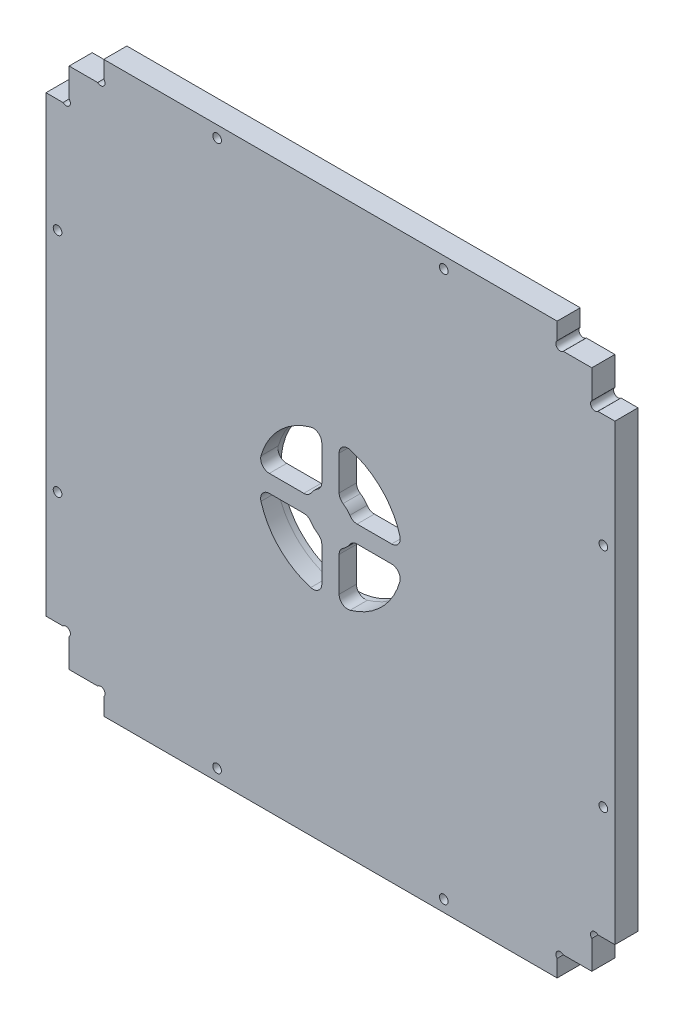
from build123d import *

# Parameters (mm, degrees)
ESQUISSE1_R             = 1.5
BOSS_EXTRU_1_DEPTH      = 8
ENL_V_MAT_EXTRU_1_DEPTH = 343.361819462
CONG_1_R                = 3
ESQUISSE3_R             = 25.1
ENL_V_MAT_EXTRU_2_DEPTH = 2
ESQUISSE4_R             = 1
ENL_V_MAT_EXTRU_3_DEPTH = 6


with BuildPart() as part:
    # Esquisse1 → Boss.-Extru.1 (new body)
    with BuildSketch(Plane.XY):
        with BuildLine():
            Line((-102.031955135, 10.484219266), (-102.031955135, -146.515780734))
            Line((-102.031955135, -146.515780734), (-107.910634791, -146.515780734))
            ThreePointArc((-107.910634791, -146.515780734), (-110.031955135, -146.515780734), (-110.031955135, -148.637101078))
            Line((-110.031955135, -148.637101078), (-110.031955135, -158.515780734))
            Line((-110.031955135, -158.515780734), (-119.910634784, -158.515780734))
            ThreePointArc((-119.910634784, -158.515780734), (-122.031955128, -158.515780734), (-122.031955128, -160.637101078))
            Line((-122.031955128, -160.637101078), (-122.031955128, -166.515780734))
            Line((-122.031955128, -166.515780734), (-229.031955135, -166.515780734))
            Line((-229.031955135, -166.515780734), (-279.031955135, -166.515780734))
            Line((-279.031955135, -166.515780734), (-279.031955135, -160.637101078))
            ThreePointArc((-279.031955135, -160.637101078), (-279.031955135, -158.515780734), (-281.153275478, -158.515780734))
            Line((-281.153275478, -158.515780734), (-291.031955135, -158.515780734))
            Line((-291.031955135, -158.515780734), (-291.031955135, -148.637101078))
            ThreePointArc((-291.031955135, -148.637101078), (-291.031955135, -146.515780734), (-293.153275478, -146.515780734))
            Line((-293.153275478, -146.515780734), (-299.031955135, -146.515780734))
            Line((-299.031955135, -146.515780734), (-299.031955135, 10.484219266))
            Line((-299.031955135, 10.484219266), (-293.153275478, 10.484219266))
            ThreePointArc((-293.153275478, 10.484219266), (-291.031955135, 10.484219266), (-291.031955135, 12.60553961))
            Line((-291.031955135, 12.60553961), (-291.031955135, 22.484219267))
            Line((-291.031955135, 22.484219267), (-281.153275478, 22.484219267))
            ThreePointArc((-281.153275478, 22.484219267), (-279.031955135, 22.484219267), (-279.031955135, 24.60553961))
            Line((-279.031955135, 24.60553961), (-279.031955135, 30.484219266))
            Line((-279.031955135, 30.484219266), (-229.031955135, 30.484219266))
            Line((-229.031955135, 30.484219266), (-122.031955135, 30.484219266))
            Line((-122.031955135, 30.484219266), (-122.031955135, 24.60553961))
            ThreePointArc((-122.031955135, 24.60553961), (-122.031955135, 22.484219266), (-119.910634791, 22.484219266))
            Line((-119.910634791, 22.484219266), (-110.031955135, 22.484219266))
            Line((-110.031955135, 22.484219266), (-110.031955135, 12.60553961))
            ThreePointArc((-110.031955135, 12.60553961), (-110.031955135, 10.484219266), (-107.910634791, 10.484219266))
            Line((-107.910634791, 10.484219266), (-102.031955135, 10.484219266))
        make_face()
        with Locations((-239.781955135, 26.484219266)):
            Circle(ESQUISSE1_R, mode=Mode.SUBTRACT)
        with Locations((-161.281955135, 26.484219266)):
            Circle(ESQUISSE1_R, mode=Mode.SUBTRACT)
        with Locations((-106.031955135, -28.765780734)):
            Circle(ESQUISSE1_R, mode=Mode.SUBTRACT)
        with Locations((-106.031955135, -107.265780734)):
            Circle(ESQUISSE1_R, mode=Mode.SUBTRACT)
        with Locations((-161.281955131, -162.515780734)):
            Circle(ESQUISSE1_R, mode=Mode.SUBTRACT)
        with Locations((-239.781955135, -162.515780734)):
            Circle(ESQUISSE1_R, mode=Mode.SUBTRACT)
        with Locations((-295.031955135, -107.265780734)):
            Circle(ESQUISSE1_R, mode=Mode.SUBTRACT)
        with Locations((-295.031955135, -28.765780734)):
            Circle(ESQUISSE1_R, mode=Mode.SUBTRACT)
    extrude(amount=BOSS_EXTRU_1_DEPTH)

    # Esquisse2 → Enl_v. mat.-Extru.1 (cut, through all)
    with BuildSketch(Plane.XY.offset(8)):
        with BuildLine():
            Line((-203.531955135, -75.431979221), (-203.531955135, -92.835128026))
            ThreePointArc((-203.531955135, -92.835128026), (-218.209624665, -85.693450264), (-225.351302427, -71.015780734))
            Line((-225.351302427, -71.015780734), (-207.948153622, -71.015780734))
            ThreePointArc((-207.948153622, -71.015780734), (-206.188809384, -73.672634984), (-203.531955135, -75.431979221))
        make_face()
        with BuildLine():
            Line((-203.531955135, -43.196433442), (-203.531955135, -60.599582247))
            ThreePointArc((-203.531955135, -60.599582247), (-206.188809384, -62.358926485), (-207.948153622, -65.015780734))
            Line((-207.948153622, -65.015780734), (-225.351302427, -65.015780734))
            ThreePointArc((-225.351302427, -65.015780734), (-218.209624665, -50.338111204), (-203.531955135, -43.196433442))
        make_face()
        with BuildLine():
            Line((-197.531955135, -75.431979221), (-197.531955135, -92.835128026))
            ThreePointArc((-197.531955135, -92.835128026), (-182.854285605, -85.693450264), (-175.712607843, -71.015780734))
            Line((-175.712607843, -71.015780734), (-193.115756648, -71.015780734))
            ThreePointArc((-193.115756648, -71.015780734), (-194.875100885, -73.672634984), (-197.531955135, -75.431979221))
        make_face()
        with BuildLine():
            Line((-197.531955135, -43.196433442), (-197.531955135, -60.599582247))
            ThreePointArc((-197.531955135, -60.599582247), (-194.875100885, -62.358926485), (-193.115756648, -65.015780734))
            Line((-193.115756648, -65.015780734), (-175.712607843, -65.015780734))
            ThreePointArc((-175.712607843, -65.015780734), (-182.854285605, -50.338111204), (-197.531955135, -43.196433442))
        make_face()
    extrude(amount=-ENL_V_MAT_EXTRU_1_DEPTH, mode=Mode.SUBTRACT)

    # Cong_1
    cong_1_edges = [part.edges().sort_by_distance(p)[0] for p in [
        (-203.531955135, -43.196433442, 4),
        (-203.531955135, -60.599582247, 4),
        (-207.948153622, -65.015780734, 4),
        (-225.351302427, -65.015780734, 4),
        (-175.712607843, -65.015780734, 4),
        (-193.115756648, -65.015780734, 4),
        (-197.531955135, -60.599582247, 4),
        (-197.531955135, -43.196433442, 4),
        (-197.531955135, -92.835128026, 4),
        (-197.531955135, -75.431979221, 4),
        (-193.115756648, -71.015780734, 4),
        (-175.712607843, -71.015780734, 4),
        (-207.948153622, -71.015780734, 4),
        (-203.531955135, -75.431979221, 4),
        (-203.531955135, -92.835128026, 4),
        (-225.351302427, -71.015780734, 4),
    ]]
    fillet(cong_1_edges, radius=CONG_1_R)

    # Esquisse3 → Enl_v. mat.-Extru.2 (cut)
    with BuildSketch(Plane(origin=(0, 0, 0), x_dir=(-1, 0, 0), z_dir=(0, 0, -1))):
        with Locations((200.531955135, -68.015780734)):
            Circle(ESQUISSE3_R)
    extrude(amount=-ENL_V_MAT_EXTRU_2_DEPTH, mode=Mode.SUBTRACT)

    # Esquisse4 → Enl_v. mat.-Extru.3 (cut)
    with BuildSketch(Plane(origin=(0, 0, 0), x_dir=(-1, 0, 0), z_dir=(0, 0, -1))):
        with Locations((200.531955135, -41.015780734)):
            Circle(ESQUISSE4_R)
        with Locations((227.531955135, -68.015780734)):
            Circle(ESQUISSE4_R)
        with Locations((200.531955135, -95.015780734)):
            Circle(ESQUISSE4_R)
        with Locations((173.531955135, -68.015780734)):
            Circle(ESQUISSE4_R)
    extrude(amount=-ENL_V_MAT_EXTRU_3_DEPTH, mode=Mode.SUBTRACT)


solid = part.part
